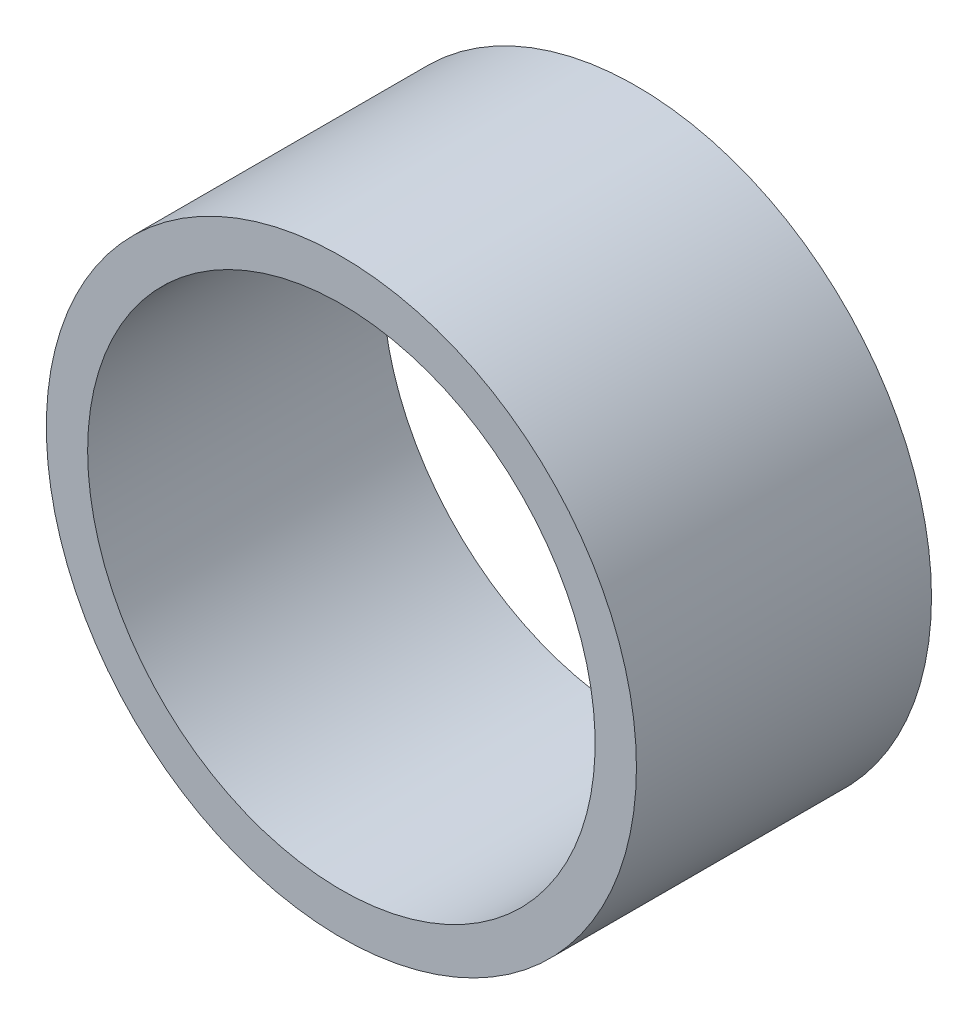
ISO-10303-21;
HEADER;
FILE_DESCRIPTION(('STEP AP214'),'2;1');
FILE_NAME('part.step','',(''),(''),'','','');
FILE_SCHEMA(('AUTOMOTIVE_DESIGN { 1 0 10303 214 1 1 1 1 }'));
ENDSEC;
DATA;
#1=APPLICATION_CONTEXT('core data for automotive mechanical design processes');
#2=APPLICATION_PROTOCOL_DEFINITION('international standard','automotive_design',2000,#1);
#3=PRODUCT_CONTEXT('',#1,'mechanical');
#4=PRODUCT('Part','Part','',(#3));
#5=PRODUCT_RELATED_PRODUCT_CATEGORY('part','',(#4));
#6=PRODUCT_DEFINITION_FORMATION('','',#4);
#7=PRODUCT_DEFINITION_CONTEXT('part definition',#1,'design');
#8=PRODUCT_DEFINITION('design','',#6,#7);
#9=PRODUCT_DEFINITION_SHAPE('','',#8);
#10=(LENGTH_UNIT() NAMED_UNIT(*) SI_UNIT(.MILLI.,.METRE.));
#11=(NAMED_UNIT(*) PLANE_ANGLE_UNIT() SI_UNIT($,.RADIAN.));
#12=(NAMED_UNIT(*) SI_UNIT($,.STERADIAN.) SOLID_ANGLE_UNIT());
#13=UNCERTAINTY_MEASURE_WITH_UNIT(LENGTH_MEASURE(1.E-05),#10,'distance_accuracy_value','');
#14=(GEOMETRIC_REPRESENTATION_CONTEXT(3) GLOBAL_UNCERTAINTY_ASSIGNED_CONTEXT((#13)) GLOBAL_UNIT_ASSIGNED_CONTEXT((#10,
#11,#12)) REPRESENTATION_CONTEXT('',''));
#15=CARTESIAN_POINT('',(0.,0.,0.));
#16=DIRECTION('',(0.,0.,1.));
#17=DIRECTION('',(1.,0.,0.));
#18=AXIS2_PLACEMENT_3D('',#15,#16,#17);
#19=CARTESIAN_POINT('',(0.,0.,6.35));
#20=DIRECTION('',(0.,0.,-1.));
#21=DIRECTION('',(-1.,0.,0.));
#22=AXIS2_PLACEMENT_3D('',#19,#20,#21);
#23=CYLINDRICAL_SURFACE('',#22,6.35);
#24=CARTESIAN_POINT('',(0.,0.,6.35));
#25=DIRECTION('',(0.,0.,1.));
#26=DIRECTION('',(1.,0.,0.));
#27=AXIS2_PLACEMENT_3D('',#24,#25,#26);
#28=CIRCLE('',#27,6.35);
#29=CARTESIAN_POINT('',(6.35,0.,6.35));
#30=VERTEX_POINT('',#29);
#31=EDGE_CURVE('E10',#30,#30,#28,.T.);
#32=ORIENTED_EDGE('',*,*,#31,.F.);
#33=EDGE_LOOP('',(#32));
#34=FACE_BOUND('',#33,.T.);
#35=CARTESIAN_POINT('',(0.,0.,0.));
#36=DIRECTION('',(0.,0.,1.));
#37=DIRECTION('',(1.,0.,0.));
#38=AXIS2_PLACEMENT_3D('',#35,#36,#37);
#39=CIRCLE('',#38,6.35);
#40=CARTESIAN_POINT('',(6.35,0.,0.));
#41=VERTEX_POINT('',#40);
#42=EDGE_CURVE('E32',#41,#41,#39,.T.);
#43=ORIENTED_EDGE('',*,*,#42,.T.);
#44=EDGE_LOOP('',(#43));
#45=FACE_BOUND('',#44,.T.);
#46=ADVANCED_FACE('F29',(#34,#45),#23,.T.);
#47=CARTESIAN_POINT('',(0.,0.,6.35));
#48=DIRECTION('',(0.,0.,1.));
#49=DIRECTION('',(1.,0.,0.));
#50=AXIS2_PLACEMENT_3D('',#47,#48,#49);
#51=PLANE('',#50);
#52=CARTESIAN_POINT('',(0.,0.,6.35));
#53=DIRECTION('',(0.,0.,-1.));
#54=DIRECTION('',(-1.,0.,0.));
#55=AXIS2_PLACEMENT_3D('',#52,#53,#54);
#56=CIRCLE('',#55,5.461);
#57=CARTESIAN_POINT('',(-5.461,0.,6.35));
#58=VERTEX_POINT('',#57);
#59=EDGE_CURVE('E39',#58,#58,#56,.T.);
#60=ORIENTED_EDGE('',*,*,#59,.T.);
#61=EDGE_LOOP('',(#60));
#62=FACE_BOUND('',#61,.T.);
#63=ORIENTED_EDGE('',*,*,#31,.T.);
#64=EDGE_LOOP('',(#63));
#65=FACE_BOUND('',#64,.T.);
#66=ADVANCED_FACE('F47',(#62,#65),#51,.T.);
#67=CARTESIAN_POINT('',(0.,0.,0.));
#68=DIRECTION('',(0.,0.,1.));
#69=DIRECTION('',(1.,0.,0.));
#70=AXIS2_PLACEMENT_3D('',#67,#68,#69);
#71=PLANE('',#70);
#72=CARTESIAN_POINT('',(0.,0.,0.));
#73=DIRECTION('',(0.,0.,-1.));
#74=DIRECTION('',(-1.,0.,0.));
#75=AXIS2_PLACEMENT_3D('',#72,#73,#74);
#76=CIRCLE('',#75,5.461);
#77=CARTESIAN_POINT('',(-5.461,0.,0.));
#78=VERTEX_POINT('',#77);
#79=EDGE_CURVE('E41',#78,#78,#76,.T.);
#80=ORIENTED_EDGE('',*,*,#79,.F.);
#81=EDGE_LOOP('',(#80));
#82=FACE_BOUND('',#81,.T.);
#83=ORIENTED_EDGE('',*,*,#42,.F.);
#84=EDGE_LOOP('',(#83));
#85=FACE_BOUND('',#84,.T.);
#86=ADVANCED_FACE('F52',(#82,#85),#71,.F.);
#87=CARTESIAN_POINT('',(0.,0.,6.35));
#88=DIRECTION('',(0.,0.,-1.));
#89=DIRECTION('',(-1.,0.,0.));
#90=AXIS2_PLACEMENT_3D('',#87,#88,#89);
#91=CYLINDRICAL_SURFACE('',#90,5.461);
#92=ORIENTED_EDGE('',*,*,#59,.F.);
#93=EDGE_LOOP('',(#92));
#94=FACE_BOUND('',#93,.T.);
#95=ORIENTED_EDGE('',*,*,#79,.T.);
#96=EDGE_LOOP('',(#95));
#97=FACE_BOUND('',#96,.T.);
#98=ADVANCED_FACE('F49',(#94,#97),#91,.F.);
#99=CLOSED_SHELL('',(#46,#66,#86,#98));
#100=MANIFOLD_SOLID_BREP('B2',#99);
#101=ADVANCED_BREP_SHAPE_REPRESENTATION('',(#18,#100),#14);
#102=SHAPE_DEFINITION_REPRESENTATION(#9,#101);
ENDSEC;
END-ISO-10303-21;
